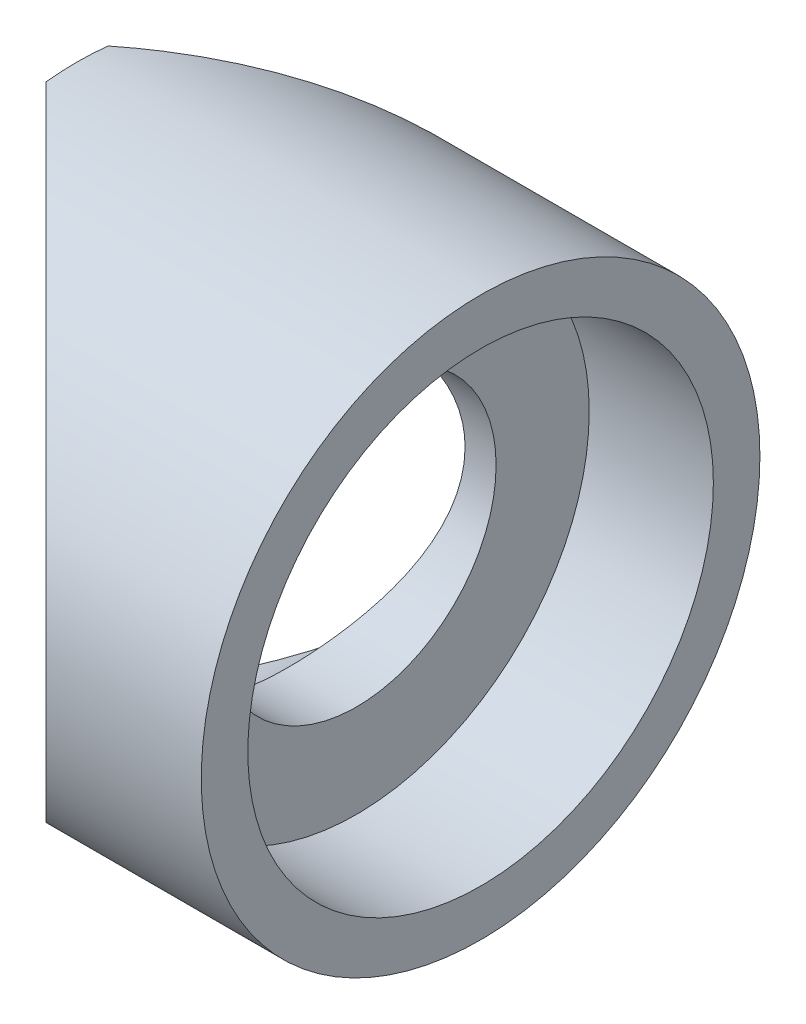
from build123d import *

# Parameters (mm, degrees)
SKETCH1_R           = 28.575
BOSS_EXTRUDE1_DEPTH = 50.8
SKETCH2_R           = 14.2875
CUT_EXTRUDE1_DEPTH  = 65.913028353
SKETCH3_R           = 23.8125
CUT_EXTRUDE2_DEPTH  = 12.7
SKETCH4_R           = 28.575
CUT_EXTRUDE3_DEPTH  = 31.75
SKETCH5_W           = 9.525
SKETCH5_H           = 57.15
CUT_EXTRUDE6_DEPTH  = 31.75


with BuildPart() as part:
    # Sketch1 → Boss-Extrude1 (new body)
    with BuildSketch(Plane(origin=(0, 0, 0), x_dir=(0, 0, -1), z_dir=(1, 0, 0))):
        Circle(SKETCH1_R)
    extrude(amount=-BOSS_EXTRUDE1_DEPTH)

    # Sketch2 → Cut-Extrude1 (cut, through all)
    with BuildSketch(Plane(origin=(0, 0, 0), x_dir=(0, 0, -1), z_dir=(1, 0, 0))):
        Circle(SKETCH2_R)
    extrude(amount=-CUT_EXTRUDE1_DEPTH, mode=Mode.SUBTRACT)

    # Sketch3 → Cut-Extrude2 (cut)
    with BuildSketch(Plane(origin=(0, 0, 0), x_dir=(0, 0, -1), z_dir=(1, 0, 0))):
        Circle(SKETCH3_R)
    extrude(amount=-CUT_EXTRUDE2_DEPTH, mode=Mode.SUBTRACT)

    # Sketch4 → Cut-Extrude3 (cut, symmetric)
    with BuildSketch(Plane.XY):
        with Locations((-44.45, 0)):
            Circle(SKETCH4_R)
    extrude(amount=CUT_EXTRUDE3_DEPTH, both=True, mode=Mode.SUBTRACT)


with BuildPart() as cut_extrude3_piece_1:
    # of the separate pieces the step leaves, piece 1, a body of its own (cut_extrude3_pieces)
    add(part.part.solids().sort_by_distance((0, 0, -28.575))[0])


with BuildPart() as cut_extrude3_piece_2:
    # of the separate pieces the step leaves, piece 2, a body of its own (cut_extrude3_pieces)
    add(part.part.solids().sort_by_distance((-50.8, -27.86051193, -6.35))[0])


with BuildPart() as cut_extrude3_piece_3:
    # of the separate pieces the step leaves, piece 3, a body of its own (cut_extrude3_pieces)
    add(part.part.solids().sort_by_distance((-50.8, 27.86051193, 6.35))[0])


with BuildPart() as cut_extrude6_tool:
    # Sketch5 → Cut-Extrude6 (new, symmetric)
    with BuildSketch(Plane.XY):
        with Locations((-46.0375, 0)):
            Rectangle(SKETCH5_W, SKETCH5_H)
    extrude(amount=CUT_EXTRUDE6_DEPTH, both=True)


with BuildPart() as cut_extrude3_piece_1_1:
    add(cut_extrude3_piece_1.part)

    # Cut-Extrude6: cut by cut_extrude6_tool
    add(cut_extrude6_tool.part, mode=Mode.SUBTRACT)


with BuildPart() as cut_extrude3_piece_2_1:
    add(cut_extrude3_piece_2.part)

    # Cut-Extrude6: cut by cut_extrude6_tool
    add(cut_extrude6_tool.part, mode=Mode.SUBTRACT)


with BuildPart() as cut_extrude3_piece_3_1:
    add(cut_extrude3_piece_3.part)

    # Cut-Extrude6: cut by cut_extrude6_tool
    add(cut_extrude6_tool.part, mode=Mode.SUBTRACT)


solid = cut_extrude3_piece_1_1.part
